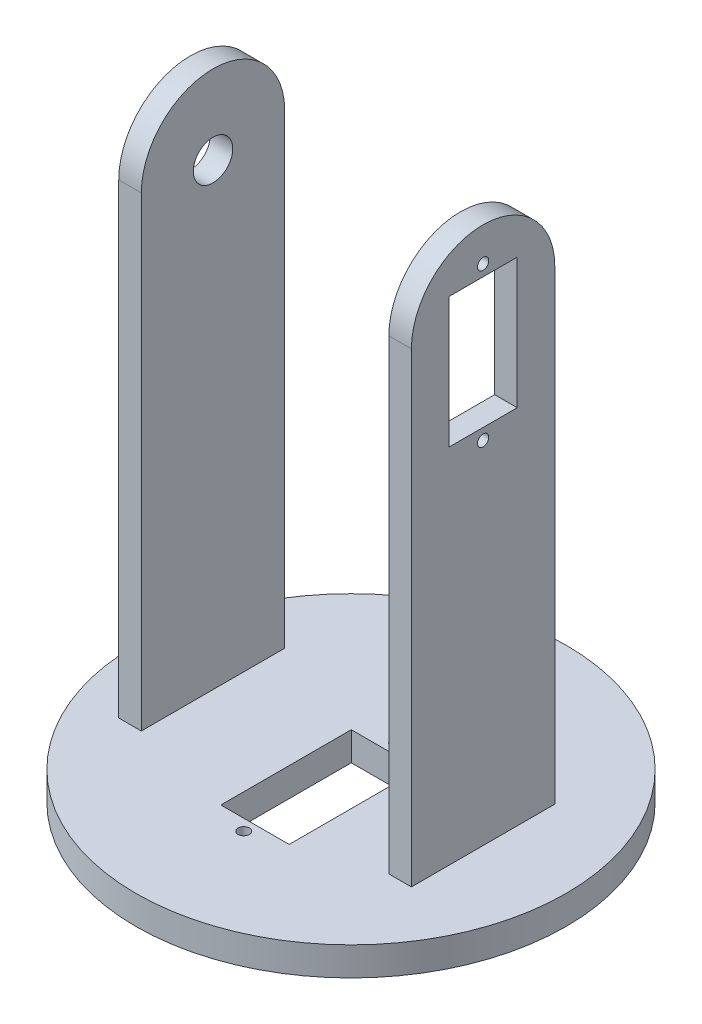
from build123d import *

# Parameters (mm, degrees)
SKETCH1_R           = 38.1
BOSS_EXTRUDE1_DEPTH = 5.08
SKETCH2_W           = 4
SKETCH2_H           = 25.4
BOSS_EXTRUDE2_DEPTH = 95.25
CUT_EXTRUDE2_REACH  = 125.693
SKETCH3_R           = 1
SKETCH3_W           = 12.1
SKETCH3_H           = 23.1
CUT_EXTRUDE3_DEPTH  = 124.693043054
CUT_EXTRUDE4_REACH  = 128.279
SKETCH5_R           = 3.5
CUT_EXTRUDE5_REACH  = 111.434
SKETCH6_R           = 1
SKETCH6_W           = 12.1
SKETCH6_H           = 23.1


with BuildPart() as part:
    # Sketch1 → Boss-Extrude1 (new body)
    with BuildSketch(Plane(origin=(0, 0, 0), x_dir=(1, 0, 0), z_dir=(0, 1, 0))):
        with Locations(Location((0, 0, 0), (0, 0, 270))):
            Circle(SKETCH1_R)
    extrude(amount=BOSS_EXTRUDE1_DEPTH)

    # Sketch2 → Boss-Extrude2 (add)
    with BuildSketch(Plane(origin=(0, 5.08, 0), x_dir=(1, 0, 0), z_dir=(0, 1, 0))):
        with Locations((-26.448, 0)):
            Rectangle(SKETCH2_W, SKETCH2_H)
        with Locations((21.4, 0)):
            Rectangle(SKETCH2_W, SKETCH2_H)
    extrude(amount=BOSS_EXTRUDE2_DEPTH)

    # Sketch3 → Cut-Extrude2 (cut, up to next)
    with BuildSketch(Plane(origin=(23.4, 0, 0), x_dir=(0, 0, -1), z_dir=(1, 0, 0)), mode=Mode.PRIVATE) as cut_extrude2_sk1:
        with Locations((0, 67.23)):
            Circle(SKETCH3_R)
    cut_extrude2_tool1 = extrude(cut_extrude2_sk1.sketch, amount=-CUT_EXTRUDE2_REACH, mode=Mode.PRIVATE) & part.part
    # Sketch3 → Cut-Extrude2 (cut, up to next)
    with BuildSketch(Plane(origin=(23.4, 0, 0), x_dir=(0, 0, -1), z_dir=(1, 0, 0)), mode=Mode.PRIVATE) as cut_extrude2_sk2:
        with Locations((0, 94.33)):
            Circle(SKETCH3_R)
    cut_extrude2_tool2 = extrude(cut_extrude2_sk2.sketch, amount=-CUT_EXTRUDE2_REACH, mode=Mode.PRIVATE) & part.part
    # Sketch3 → Cut-Extrude2 (cut, up to next)
    with BuildSketch(Plane(origin=(23.4, 0, 0), x_dir=(0, 0, -1), z_dir=(1, 0, 0)), mode=Mode.PRIVATE) as cut_extrude2_sk3:
        with Locations((0, 80.78)):
            Rectangle(SKETCH3_W, SKETCH3_H)
    cut_extrude2_tool3 = extrude(cut_extrude2_sk3.sketch, amount=-CUT_EXTRUDE2_REACH, mode=Mode.PRIVATE) & part.part
    add(cut_extrude2_tool1.solids().sort_by_distance((23.4, 67.23, 0))[0], mode=Mode.SUBTRACT)
    add(cut_extrude2_tool2.solids().sort_by_distance((23.4, 94.33, 0))[0], mode=Mode.SUBTRACT)
    add(cut_extrude2_tool3.solids().sort_by_distance((23.4, 80.78, 0))[0], mode=Mode.SUBTRACT)

    # Sketch4 → Cut-Extrude3 (cut, through all)
    with BuildSketch(Plane(origin=(23.4, 0, 0), x_dir=(0, 0, -1), z_dir=(1, 0, 0))):
        with BuildLine():
            Line((0, 100.33), (-12.7, 100.33))
            Line((-12.7, 100.33), (-12.7, 87.63))
            ThreePointArc((-12.7, 87.63), (-8.980256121, 96.610256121), (0, 100.33))
        make_face()
        with BuildLine():
            Line((12.7, 100.33), (0, 100.33))
            ThreePointArc((0, 100.33), (8.980256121, 96.610256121), (12.7, 87.63))
            Line((12.7, 87.63), (12.7, 100.33))
        make_face()
    extrude(amount=-CUT_EXTRUDE3_DEPTH, mode=Mode.SUBTRACT)

    # Sketch5 → Cut-Extrude4 (cut, up to next)
    with BuildSketch(Plane.ZY.offset(28.448), mode=Mode.PRIVATE) as cut_extrude4_sk1:
        with Locations((0, 86.33)):
            Circle(SKETCH5_R)
    cut_extrude4_tool1 = extrude(cut_extrude4_sk1.sketch, amount=-CUT_EXTRUDE4_REACH, mode=Mode.PRIVATE) & part.part
    add(cut_extrude4_tool1.solids().sort_by_distance((-28.448, 86.33, 0))[0], mode=Mode.SUBTRACT)

    # Sketch6 → Cut-Extrude5 (cut, up to next)
    with BuildSketch(Plane(origin=(0, 5.08, 0), x_dir=(1, 0, 0), z_dir=(0, 1, 0)), mode=Mode.PRIVATE) as cut_extrude5_sk1:
        with Locations(Location((0, -19.004, 0), (0, 0, 270))):
            Circle(SKETCH6_R)
    cut_extrude5_tool1 = extrude(cut_extrude5_sk1.sketch, amount=-CUT_EXTRUDE5_REACH, mode=Mode.PRIVATE) & part.part
    # Sketch6 → Cut-Extrude5 (cut, up to next)
    with BuildSketch(Plane(origin=(0, 5.08, 0), x_dir=(1, 0, 0), z_dir=(0, 1, 0)), mode=Mode.PRIVATE) as cut_extrude5_sk2:
        with Locations(Location((0, 8.096, 0), (0, 0, 270))):
            Circle(SKETCH6_R)
    cut_extrude5_tool2 = extrude(cut_extrude5_sk2.sketch, amount=-CUT_EXTRUDE5_REACH, mode=Mode.PRIVATE) & part.part
    # Sketch6 → Cut-Extrude5 (cut, up to next)
    with BuildSketch(Plane(origin=(0, 5.08, 0), x_dir=(1, 0, 0), z_dir=(0, 1, 0)), mode=Mode.PRIVATE) as cut_extrude5_sk3:
        with Locations((0, -5.454)):
            Rectangle(SKETCH6_W, SKETCH6_H)
    cut_extrude5_tool3 = extrude(cut_extrude5_sk3.sketch, amount=-CUT_EXTRUDE5_REACH, mode=Mode.PRIVATE) & part.part
    add(cut_extrude5_tool1.solids().sort_by_distance((0, 5.08, 19.004))[0], mode=Mode.SUBTRACT)
    add(cut_extrude5_tool2.solids().sort_by_distance((0, 5.08, -8.096))[0], mode=Mode.SUBTRACT)
    add(cut_extrude5_tool3.solids().sort_by_distance((0, 5.08, 5.454))[0], mode=Mode.SUBTRACT)


solid = part.part
